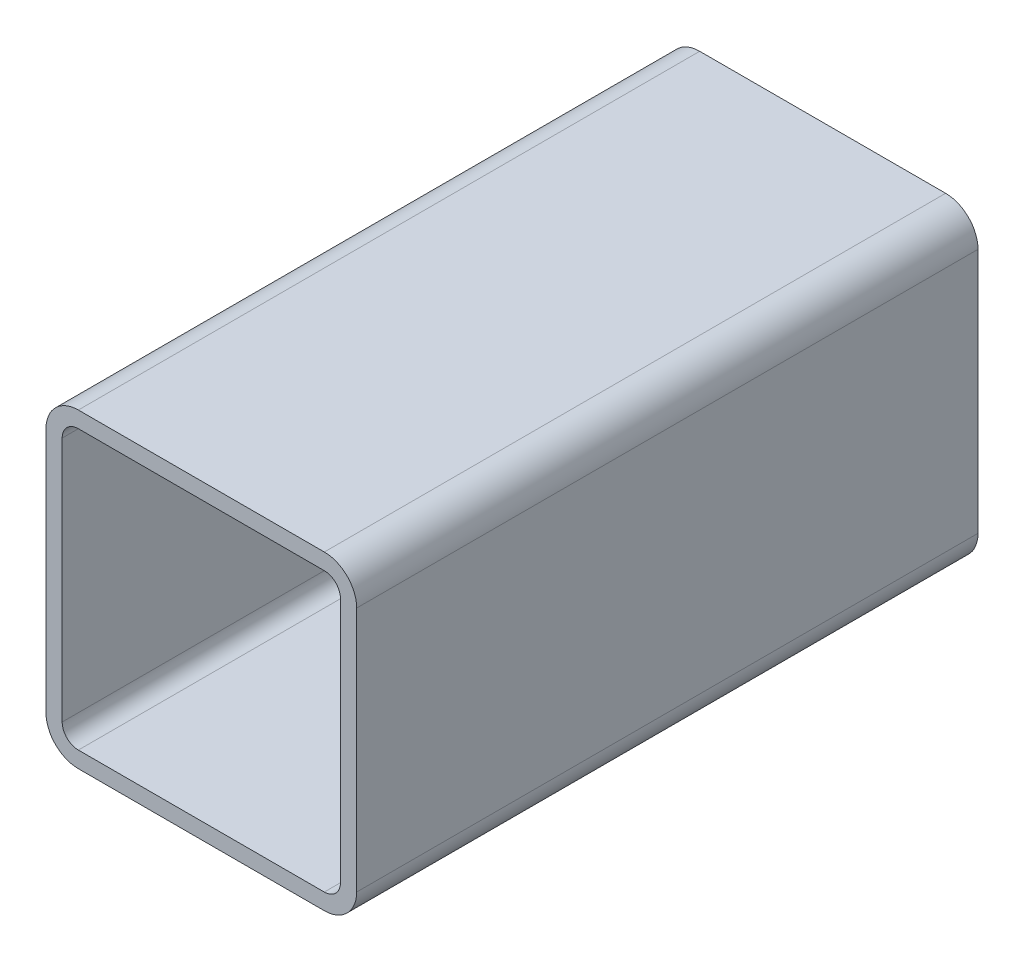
ISO-10303-21;
HEADER;
FILE_DESCRIPTION(('STEP AP214'),'2;1');
FILE_NAME('part.step','',(''),(''),'','','');
FILE_SCHEMA(('AUTOMOTIVE_DESIGN { 1 0 10303 214 1 1 1 1 }'));
ENDSEC;
DATA;
#1=APPLICATION_CONTEXT('core data for automotive mechanical design processes');
#2=APPLICATION_PROTOCOL_DEFINITION('international standard','automotive_design',2000,#1);
#3=PRODUCT_CONTEXT('',#1,'mechanical');
#4=PRODUCT('Part','Part','',(#3));
#5=PRODUCT_RELATED_PRODUCT_CATEGORY('part','',(#4));
#6=PRODUCT_DEFINITION_FORMATION('','',#4);
#7=PRODUCT_DEFINITION_CONTEXT('part definition',#1,'design');
#8=PRODUCT_DEFINITION('design','',#6,#7);
#9=PRODUCT_DEFINITION_SHAPE('','',#8);
#10=(LENGTH_UNIT() NAMED_UNIT(*) SI_UNIT(.MILLI.,.METRE.));
#11=(NAMED_UNIT(*) PLANE_ANGLE_UNIT() SI_UNIT($,.RADIAN.));
#12=(NAMED_UNIT(*) SI_UNIT($,.STERADIAN.) SOLID_ANGLE_UNIT());
#13=UNCERTAINTY_MEASURE_WITH_UNIT(LENGTH_MEASURE(1.E-05),#10,'distance_accuracy_value','');
#14=(GEOMETRIC_REPRESENTATION_CONTEXT(3) GLOBAL_UNCERTAINTY_ASSIGNED_CONTEXT((#13)) GLOBAL_UNIT_ASSIGNED_CONTEXT((#10,
#11,#12)) REPRESENTATION_CONTEXT('',''));
#15=CARTESIAN_POINT('',(0.,0.,0.));
#16=DIRECTION('',(0.,0.,1.));
#17=DIRECTION('',(1.,0.,0.));
#18=AXIS2_PLACEMENT_3D('',#15,#16,#17);
#19=CARTESIAN_POINT('',(15.9223013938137,138.536948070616,304.8));
#20=DIRECTION('',(0.,0.,1.));
#21=DIRECTION('',(1.,0.,0.));
#22=AXIS2_PLACEMENT_3D('',#19,#20,#21);
#23=PLANE('',#22);
#24=CARTESIAN_POINT('',(15.9223013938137,138.536948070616,304.8));
#25=DIRECTION('',(0.,0.,1.));
#26=DIRECTION('',(1.,0.,0.));
#27=AXIS2_PLACEMENT_3D('',#24,#25,#26);
#28=CIRCLE('',#27,15.875);
#29=CARTESIAN_POINT('',(15.9223013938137,154.411948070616,304.8));
#30=VERTEX_POINT('',#29);
#31=CARTESIAN_POINT('',(0.0473013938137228,138.536948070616,304.8));
#32=VERTEX_POINT('',#31);
#33=EDGE_CURVE('E211',#30,#32,#28,.T.);
#34=ORIENTED_EDGE('',*,*,#33,.T.);
#35=DIRECTION('',(0.,-1.,0.));
#36=VECTOR('',#35,1.);
#37=CARTESIAN_POINT('',(0.0473013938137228,17.8869480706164,304.8));
#38=LINE('',#37,#36);
#39=CARTESIAN_POINT('',(0.0473013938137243,17.8869480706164,304.8));
#40=VERTEX_POINT('',#39);
#41=EDGE_CURVE('E214',#32,#40,#38,.T.);
#42=ORIENTED_EDGE('',*,*,#41,.T.);
#43=CARTESIAN_POINT('',(15.9223013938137,17.8869480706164,304.8));
#44=DIRECTION('',(0.,0.,1.));
#45=DIRECTION('',(1.,0.,0.));
#46=AXIS2_PLACEMENT_3D('',#43,#44,#45);
#47=CIRCLE('',#46,15.875);
#48=CARTESIAN_POINT('',(15.9223013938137,2.01194807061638,304.8));
#49=VERTEX_POINT('',#48);
#50=EDGE_CURVE('E217',#40,#49,#47,.T.);
#51=ORIENTED_EDGE('',*,*,#50,.T.);
#52=DIRECTION('',(1.,0.,0.));
#53=VECTOR('',#52,1.);
#54=CARTESIAN_POINT('',(136.572301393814,2.01194807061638,304.8));
#55=LINE('',#54,#53);
#56=CARTESIAN_POINT('',(136.572301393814,2.01194807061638,304.8));
#57=VERTEX_POINT('',#56);
#58=EDGE_CURVE('E219',#49,#57,#55,.T.);
#59=ORIENTED_EDGE('',*,*,#58,.T.);
#60=CARTESIAN_POINT('',(136.572301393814,17.8869480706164,304.8));
#61=DIRECTION('',(0.,0.,1.));
#62=DIRECTION('',(1.,0.,0.));
#63=AXIS2_PLACEMENT_3D('',#60,#61,#62);
#64=CIRCLE('',#63,15.875);
#65=CARTESIAN_POINT('',(152.447301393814,17.8869480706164,304.8));
#66=VERTEX_POINT('',#65);
#67=EDGE_CURVE('E221',#57,#66,#64,.T.);
#68=ORIENTED_EDGE('',*,*,#67,.T.);
#69=DIRECTION('',(0.,1.,0.));
#70=VECTOR('',#69,1.);
#71=CARTESIAN_POINT('',(152.447301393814,138.536948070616,304.8));
#72=LINE('',#71,#70);
#73=CARTESIAN_POINT('',(152.447301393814,138.536948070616,304.8));
#74=VERTEX_POINT('',#73);
#75=EDGE_CURVE('E223',#66,#74,#72,.T.);
#76=ORIENTED_EDGE('',*,*,#75,.T.);
#77=CARTESIAN_POINT('',(136.572301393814,138.536948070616,304.8));
#78=DIRECTION('',(0.,0.,1.));
#79=DIRECTION('',(1.,0.,0.));
#80=AXIS2_PLACEMENT_3D('',#77,#78,#79);
#81=CIRCLE('',#80,15.875);
#82=CARTESIAN_POINT('',(136.572301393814,154.411948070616,304.8));
#83=VERTEX_POINT('',#82);
#84=EDGE_CURVE('E225',#74,#83,#81,.T.);
#85=ORIENTED_EDGE('',*,*,#84,.T.);
#86=DIRECTION('',(-1.,0.,0.));
#87=VECTOR('',#86,1.);
#88=CARTESIAN_POINT('',(15.9223013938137,154.411948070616,304.8));
#89=LINE('',#88,#87);
#90=EDGE_CURVE('E227',#83,#30,#89,.T.);
#91=ORIENTED_EDGE('',*,*,#90,.T.);
#92=EDGE_LOOP('',(#34,#42,#51,#59,#68,#76,#85,#91));
#93=FACE_BOUND('',#92,.T.);
#94=DIRECTION('',(0.,-1.,0.));
#95=VECTOR('',#94,1.);
#96=CARTESIAN_POINT('',(7.98480139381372,17.8869480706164,304.8));
#97=LINE('',#96,#95);
#98=CARTESIAN_POINT('',(7.98480139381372,138.536948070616,304.8));
#99=VERTEX_POINT('',#98);
#100=CARTESIAN_POINT('',(7.98480139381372,17.8869480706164,304.8));
#101=VERTEX_POINT('',#100);
#102=EDGE_CURVE('E154',#99,#101,#97,.T.);
#103=ORIENTED_EDGE('',*,*,#102,.F.);
#104=CARTESIAN_POINT('',(15.9223013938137,138.536948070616,304.8));
#105=DIRECTION('',(0.,0.,1.));
#106=DIRECTION('',(1.,0.,0.));
#107=AXIS2_PLACEMENT_3D('',#104,#105,#106);
#108=CIRCLE('',#107,7.93750000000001);
#109=CARTESIAN_POINT('',(15.9223013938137,146.474448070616,304.8));
#110=VERTEX_POINT('',#109);
#111=EDGE_CURVE('E146',#110,#99,#108,.T.);
#112=ORIENTED_EDGE('',*,*,#111,.F.);
#113=DIRECTION('',(-1.,0.,0.));
#114=VECTOR('',#113,1.);
#115=CARTESIAN_POINT('',(15.9223013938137,146.474448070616,304.8));
#116=LINE('',#115,#114);
#117=CARTESIAN_POINT('',(136.572301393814,146.474448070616,304.8));
#118=VERTEX_POINT('',#117);
#119=EDGE_CURVE('E179',#118,#110,#116,.T.);
#120=ORIENTED_EDGE('',*,*,#119,.F.);
#121=CARTESIAN_POINT('',(136.572301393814,138.536948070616,304.8));
#122=DIRECTION('',(0.,0.,1.));
#123=DIRECTION('',(1.,0.,0.));
#124=AXIS2_PLACEMENT_3D('',#121,#122,#123);
#125=CIRCLE('',#124,7.93750000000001);
#126=CARTESIAN_POINT('',(144.509801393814,138.536948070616,304.8));
#127=VERTEX_POINT('',#126);
#128=EDGE_CURVE('E177',#127,#118,#125,.T.);
#129=ORIENTED_EDGE('',*,*,#128,.F.);
#130=DIRECTION('',(0.,1.,0.));
#131=VECTOR('',#130,1.);
#132=CARTESIAN_POINT('',(144.509801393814,138.536948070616,304.8));
#133=LINE('',#132,#131);
#134=CARTESIAN_POINT('',(144.509801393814,17.8869480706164,304.8));
#135=VERTEX_POINT('',#134);
#136=EDGE_CURVE('E175',#135,#127,#133,.T.);
#137=ORIENTED_EDGE('',*,*,#136,.F.);
#138=CARTESIAN_POINT('',(136.572301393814,17.8869480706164,304.8));
#139=DIRECTION('',(0.,0.,1.));
#140=DIRECTION('',(1.,0.,0.));
#141=AXIS2_PLACEMENT_3D('',#138,#139,#140);
#142=CIRCLE('',#141,7.93750000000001);
#143=CARTESIAN_POINT('',(136.572301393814,9.94944807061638,304.8));
#144=VERTEX_POINT('',#143);
#145=EDGE_CURVE('E173',#144,#135,#142,.T.);
#146=ORIENTED_EDGE('',*,*,#145,.F.);
#147=DIRECTION('',(1.,0.,0.));
#148=VECTOR('',#147,1.);
#149=CARTESIAN_POINT('',(136.572301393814,9.94944807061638,304.8));
#150=LINE('',#149,#148);
#151=CARTESIAN_POINT('',(15.9223013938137,9.94944807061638,304.8));
#152=VERTEX_POINT('',#151);
#153=EDGE_CURVE('E169',#152,#144,#150,.T.);
#154=ORIENTED_EDGE('',*,*,#153,.F.);
#155=CARTESIAN_POINT('',(15.9223013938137,17.8869480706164,304.8));
#156=DIRECTION('',(0.,0.,1.));
#157=DIRECTION('',(1.,0.,0.));
#158=AXIS2_PLACEMENT_3D('',#155,#156,#157);
#159=CIRCLE('',#158,7.9375);
#160=EDGE_CURVE('E167',#101,#152,#159,.T.);
#161=ORIENTED_EDGE('',*,*,#160,.F.);
#162=EDGE_LOOP('',(#103,#112,#120,#129,#137,#146,#154,#161));
#163=FACE_BOUND('',#162,.T.);
#164=ADVANCED_FACE('F33',(#93,#163),#23,.T.);
#165=CARTESIAN_POINT('',(15.9223013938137,138.536948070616,0.));
#166=DIRECTION('',(0.,0.,1.));
#167=DIRECTION('',(1.,0.,0.));
#168=AXIS2_PLACEMENT_3D('',#165,#166,#167);
#169=PLANE('',#168);
#170=CARTESIAN_POINT('',(15.9223013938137,138.536948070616,0.));
#171=DIRECTION('',(0.,0.,1.));
#172=DIRECTION('',(1.,0.,0.));
#173=AXIS2_PLACEMENT_3D('',#170,#171,#172);
#174=CIRCLE('',#173,15.875);
#175=CARTESIAN_POINT('',(15.9223013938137,154.411948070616,0.));
#176=VERTEX_POINT('',#175);
#177=CARTESIAN_POINT('',(0.0473013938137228,138.536948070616,0.));
#178=VERTEX_POINT('',#177);
#179=EDGE_CURVE('E162',#176,#178,#174,.T.);
#180=ORIENTED_EDGE('',*,*,#179,.F.);
#181=DIRECTION('',(-1.,0.,0.));
#182=VECTOR('',#181,1.);
#183=CARTESIAN_POINT('',(15.9223013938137,154.411948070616,0.));
#184=LINE('',#183,#182);
#185=CARTESIAN_POINT('',(136.572301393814,154.411948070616,0.));
#186=VERTEX_POINT('',#185);
#187=EDGE_CURVE('E215',#186,#176,#184,.T.);
#188=ORIENTED_EDGE('',*,*,#187,.F.);
#189=CARTESIAN_POINT('',(136.572301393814,138.536948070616,0.));
#190=DIRECTION('',(0.,0.,1.));
#191=DIRECTION('',(1.,0.,0.));
#192=AXIS2_PLACEMENT_3D('',#189,#190,#191);
#193=CIRCLE('',#192,15.875);
#194=CARTESIAN_POINT('',(152.447301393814,138.536948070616,0.));
#195=VERTEX_POINT('',#194);
#196=EDGE_CURVE('E242',#195,#186,#193,.T.);
#197=ORIENTED_EDGE('',*,*,#196,.F.);
#198=DIRECTION('',(0.,1.,0.));
#199=VECTOR('',#198,1.);
#200=CARTESIAN_POINT('',(152.447301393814,138.536948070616,0.));
#201=LINE('',#200,#199);
#202=CARTESIAN_POINT('',(152.447301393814,17.8869480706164,0.));
#203=VERTEX_POINT('',#202);
#204=EDGE_CURVE('E240',#203,#195,#201,.T.);
#205=ORIENTED_EDGE('',*,*,#204,.F.);
#206=CARTESIAN_POINT('',(136.572301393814,17.8869480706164,0.));
#207=DIRECTION('',(0.,0.,1.));
#208=DIRECTION('',(1.,0.,0.));
#209=AXIS2_PLACEMENT_3D('',#206,#207,#208);
#210=CIRCLE('',#209,15.875);
#211=CARTESIAN_POINT('',(136.572301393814,2.01194807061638,0.));
#212=VERTEX_POINT('',#211);
#213=EDGE_CURVE('E238',#212,#203,#210,.T.);
#214=ORIENTED_EDGE('',*,*,#213,.F.);
#215=DIRECTION('',(1.,0.,0.));
#216=VECTOR('',#215,1.);
#217=CARTESIAN_POINT('',(136.572301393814,2.01194807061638,0.));
#218=LINE('',#217,#216);
#219=CARTESIAN_POINT('',(15.9223013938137,2.01194807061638,0.));
#220=VERTEX_POINT('',#219);
#221=EDGE_CURVE('E236',#220,#212,#218,.T.);
#222=ORIENTED_EDGE('',*,*,#221,.F.);
#223=CARTESIAN_POINT('',(15.9223013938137,17.8869480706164,0.));
#224=DIRECTION('',(0.,0.,1.));
#225=DIRECTION('',(1.,0.,0.));
#226=AXIS2_PLACEMENT_3D('',#223,#224,#225);
#227=CIRCLE('',#226,15.875);
#228=CARTESIAN_POINT('',(0.0473013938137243,17.8869480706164,0.));
#229=VERTEX_POINT('',#228);
#230=EDGE_CURVE('E234',#229,#220,#227,.T.);
#231=ORIENTED_EDGE('',*,*,#230,.F.);
#232=DIRECTION('',(0.,-1.,0.));
#233=VECTOR('',#232,1.);
#234=CARTESIAN_POINT('',(0.0473013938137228,17.8869480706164,0.));
#235=LINE('',#234,#233);
#236=EDGE_CURVE('E232',#178,#229,#235,.T.);
#237=ORIENTED_EDGE('',*,*,#236,.F.);
#238=EDGE_LOOP('',(#180,#188,#197,#205,#214,#222,#231,#237));
#239=FACE_BOUND('',#238,.T.);
#240=CARTESIAN_POINT('',(15.9223013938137,138.536948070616,0.));
#241=DIRECTION('',(0.,0.,1.));
#242=DIRECTION('',(1.,0.,0.));
#243=AXIS2_PLACEMENT_3D('',#240,#241,#242);
#244=CIRCLE('',#243,7.93750000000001);
#245=CARTESIAN_POINT('',(15.9223013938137,146.474448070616,0.));
#246=VERTEX_POINT('',#245);
#247=CARTESIAN_POINT('',(7.98480139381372,138.536948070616,0.));
#248=VERTEX_POINT('',#247);
#249=EDGE_CURVE('E56',#246,#248,#244,.T.);
#250=ORIENTED_EDGE('',*,*,#249,.T.);
#251=DIRECTION('',(0.,-1.,0.));
#252=VECTOR('',#251,1.);
#253=CARTESIAN_POINT('',(7.98480139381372,17.8869480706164,0.));
#254=LINE('',#253,#252);
#255=CARTESIAN_POINT('',(7.98480139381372,17.8869480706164,0.));
#256=VERTEX_POINT('',#255);
#257=EDGE_CURVE('E161',#248,#256,#254,.T.);
#258=ORIENTED_EDGE('',*,*,#257,.T.);
#259=CARTESIAN_POINT('',(15.9223013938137,17.8869480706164,0.));
#260=DIRECTION('',(0.,0.,1.));
#261=DIRECTION('',(1.,0.,0.));
#262=AXIS2_PLACEMENT_3D('',#259,#260,#261);
#263=CIRCLE('',#262,7.9375);
#264=CARTESIAN_POINT('',(15.9223013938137,9.94944807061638,0.));
#265=VERTEX_POINT('',#264);
#266=EDGE_CURVE('E183',#256,#265,#263,.T.);
#267=ORIENTED_EDGE('',*,*,#266,.T.);
#268=DIRECTION('',(1.,0.,0.));
#269=VECTOR('',#268,1.);
#270=CARTESIAN_POINT('',(136.572301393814,9.94944807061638,0.));
#271=LINE('',#270,#269);
#272=CARTESIAN_POINT('',(136.572301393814,9.94944807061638,0.));
#273=VERTEX_POINT('',#272);
#274=EDGE_CURVE('E186',#265,#273,#271,.T.);
#275=ORIENTED_EDGE('',*,*,#274,.T.);
#276=CARTESIAN_POINT('',(136.572301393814,17.8869480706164,0.));
#277=DIRECTION('',(0.,0.,1.));
#278=DIRECTION('',(1.,0.,0.));
#279=AXIS2_PLACEMENT_3D('',#276,#277,#278);
#280=CIRCLE('',#279,7.93750000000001);
#281=CARTESIAN_POINT('',(144.509801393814,17.8869480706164,0.));
#282=VERTEX_POINT('',#281);
#283=EDGE_CURVE('E189',#273,#282,#280,.T.);
#284=ORIENTED_EDGE('',*,*,#283,.T.);
#285=DIRECTION('',(0.,1.,0.));
#286=VECTOR('',#285,1.);
#287=CARTESIAN_POINT('',(144.509801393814,138.536948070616,0.));
#288=LINE('',#287,#286);
#289=CARTESIAN_POINT('',(144.509801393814,138.536948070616,0.));
#290=VERTEX_POINT('',#289);
#291=EDGE_CURVE('E192',#282,#290,#288,.T.);
#292=ORIENTED_EDGE('',*,*,#291,.T.);
#293=CARTESIAN_POINT('',(136.572301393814,138.536948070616,0.));
#294=DIRECTION('',(0.,0.,1.));
#295=DIRECTION('',(1.,0.,0.));
#296=AXIS2_PLACEMENT_3D('',#293,#294,#295);
#297=CIRCLE('',#296,7.93750000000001);
#298=CARTESIAN_POINT('',(136.572301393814,146.474448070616,0.));
#299=VERTEX_POINT('',#298);
#300=EDGE_CURVE('E195',#290,#299,#297,.T.);
#301=ORIENTED_EDGE('',*,*,#300,.T.);
#302=DIRECTION('',(-1.,0.,0.));
#303=VECTOR('',#302,1.);
#304=CARTESIAN_POINT('',(15.9223013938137,146.474448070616,0.));
#305=LINE('',#304,#303);
#306=EDGE_CURVE('E155',#299,#246,#305,.T.);
#307=ORIENTED_EDGE('',*,*,#306,.T.);
#308=EDGE_LOOP('',(#250,#258,#267,#275,#284,#292,#301,#307));
#309=FACE_BOUND('',#308,.T.);
#310=ADVANCED_FACE('F272',(#239,#309),#169,.F.);
#311=CARTESIAN_POINT('',(15.9223013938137,138.536948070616,304.8));
#312=DIRECTION('',(0.,0.,-1.));
#313=DIRECTION('',(-1.,0.,0.));
#314=AXIS2_PLACEMENT_3D('',#311,#312,#313);
#315=CYLINDRICAL_SURFACE('',#314,15.875);
#316=ORIENTED_EDGE('',*,*,#179,.T.);
#317=DIRECTION('',(0.,0.,-1.));
#318=VECTOR('',#317,1.);
#319=CARTESIAN_POINT('',(0.0473013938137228,138.536948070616,304.8));
#320=LINE('',#319,#318);
#321=EDGE_CURVE('E11',#32,#178,#320,.T.);
#322=ORIENTED_EDGE('',*,*,#321,.F.);
#323=ORIENTED_EDGE('',*,*,#33,.F.);
#324=DIRECTION('',(0.,0.,-1.));
#325=VECTOR('',#324,1.);
#326=CARTESIAN_POINT('',(15.9223013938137,154.411948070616,304.8));
#327=LINE('',#326,#325);
#328=EDGE_CURVE('E229',#30,#176,#327,.T.);
#329=ORIENTED_EDGE('',*,*,#328,.T.);
#330=EDGE_LOOP('',(#316,#322,#323,#329));
#331=FACE_BOUND('',#330,.T.);
#332=ADVANCED_FACE('F35',(#331),#315,.T.);
#333=CARTESIAN_POINT('',(0.0473013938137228,17.8869480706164,304.8));
#334=DIRECTION('',(1.,0.,0.));
#335=DIRECTION('',(0.,0.,-1.));
#336=AXIS2_PLACEMENT_3D('',#333,#334,#335);
#337=PLANE('',#336);
#338=ORIENTED_EDGE('',*,*,#236,.T.);
#339=DIRECTION('',(0.,0.,-1.));
#340=VECTOR('',#339,1.);
#341=CARTESIAN_POINT('',(0.0473013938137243,17.8869480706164,304.8));
#342=LINE('',#341,#340);
#343=EDGE_CURVE('E41',#40,#229,#342,.T.);
#344=ORIENTED_EDGE('',*,*,#343,.F.);
#345=ORIENTED_EDGE('',*,*,#41,.F.);
#346=ORIENTED_EDGE('',*,*,#321,.T.);
#347=EDGE_LOOP('',(#338,#344,#345,#346));
#348=FACE_BOUND('',#347,.T.);
#349=ADVANCED_FACE('F289',(#348),#337,.F.);
#350=CARTESIAN_POINT('',(15.9223013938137,17.8869480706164,304.8));
#351=DIRECTION('',(0.,0.,-1.));
#352=DIRECTION('',(-1.,0.,0.));
#353=AXIS2_PLACEMENT_3D('',#350,#351,#352);
#354=CYLINDRICAL_SURFACE('',#353,15.875);
#355=ORIENTED_EDGE('',*,*,#230,.T.);
#356=DIRECTION('',(0.,0.,-1.));
#357=VECTOR('',#356,1.);
#358=CARTESIAN_POINT('',(15.9223013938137,2.01194807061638,304.8));
#359=LINE('',#358,#357);
#360=EDGE_CURVE('E259',#49,#220,#359,.T.);
#361=ORIENTED_EDGE('',*,*,#360,.F.);
#362=ORIENTED_EDGE('',*,*,#50,.F.);
#363=ORIENTED_EDGE('',*,*,#343,.T.);
#364=EDGE_LOOP('',(#355,#361,#362,#363));
#365=FACE_BOUND('',#364,.T.);
#366=ADVANCED_FACE('F266',(#365),#354,.T.);
#367=CARTESIAN_POINT('',(136.572301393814,2.01194807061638,304.8));
#368=DIRECTION('',(0.,1.,0.));
#369=DIRECTION('',(0.,0.,1.));
#370=AXIS2_PLACEMENT_3D('',#367,#368,#369);
#371=PLANE('',#370);
#372=ORIENTED_EDGE('',*,*,#221,.T.);
#373=DIRECTION('',(0.,0.,-1.));
#374=VECTOR('',#373,1.);
#375=CARTESIAN_POINT('',(136.572301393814,2.01194807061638,304.8));
#376=LINE('',#375,#374);
#377=EDGE_CURVE('E256',#57,#212,#376,.T.);
#378=ORIENTED_EDGE('',*,*,#377,.F.);
#379=ORIENTED_EDGE('',*,*,#58,.F.);
#380=ORIENTED_EDGE('',*,*,#360,.T.);
#381=EDGE_LOOP('',(#372,#378,#379,#380));
#382=FACE_BOUND('',#381,.T.);
#383=ADVANCED_FACE('F278',(#382),#371,.F.);
#384=CARTESIAN_POINT('',(136.572301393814,17.8869480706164,304.8));
#385=DIRECTION('',(0.,0.,-1.));
#386=DIRECTION('',(-1.,0.,0.));
#387=AXIS2_PLACEMENT_3D('',#384,#385,#386);
#388=CYLINDRICAL_SURFACE('',#387,15.875);
#389=ORIENTED_EDGE('',*,*,#213,.T.);
#390=DIRECTION('',(0.,0.,-1.));
#391=VECTOR('',#390,1.);
#392=CARTESIAN_POINT('',(152.447301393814,17.8869480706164,304.8));
#393=LINE('',#392,#391);
#394=EDGE_CURVE('E253',#66,#203,#393,.T.);
#395=ORIENTED_EDGE('',*,*,#394,.F.);
#396=ORIENTED_EDGE('',*,*,#67,.F.);
#397=ORIENTED_EDGE('',*,*,#377,.T.);
#398=EDGE_LOOP('',(#389,#395,#396,#397));
#399=FACE_BOUND('',#398,.T.);
#400=ADVANCED_FACE('F282',(#399),#388,.T.);
#401=CARTESIAN_POINT('',(152.447301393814,138.536948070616,304.8));
#402=DIRECTION('',(-1.,0.,0.));
#403=DIRECTION('',(0.,0.,1.));
#404=AXIS2_PLACEMENT_3D('',#401,#402,#403);
#405=PLANE('',#404);
#406=ORIENTED_EDGE('',*,*,#204,.T.);
#407=DIRECTION('',(0.,0.,-1.));
#408=VECTOR('',#407,1.);
#409=CARTESIAN_POINT('',(152.447301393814,138.536948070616,304.8));
#410=LINE('',#409,#408);
#411=EDGE_CURVE('E250',#74,#195,#410,.T.);
#412=ORIENTED_EDGE('',*,*,#411,.F.);
#413=ORIENTED_EDGE('',*,*,#75,.F.);
#414=ORIENTED_EDGE('',*,*,#394,.T.);
#415=EDGE_LOOP('',(#406,#412,#413,#414));
#416=FACE_BOUND('',#415,.T.);
#417=ADVANCED_FACE('F302',(#416),#405,.F.);
#418=CARTESIAN_POINT('',(136.572301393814,138.536948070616,304.8));
#419=DIRECTION('',(0.,0.,-1.));
#420=DIRECTION('',(-1.,0.,0.));
#421=AXIS2_PLACEMENT_3D('',#418,#419,#420);
#422=CYLINDRICAL_SURFACE('',#421,15.875);
#423=ORIENTED_EDGE('',*,*,#196,.T.);
#424=DIRECTION('',(0.,0.,-1.));
#425=VECTOR('',#424,1.);
#426=CARTESIAN_POINT('',(136.572301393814,154.411948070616,304.8));
#427=LINE('',#426,#425);
#428=EDGE_CURVE('E247',#83,#186,#427,.T.);
#429=ORIENTED_EDGE('',*,*,#428,.F.);
#430=ORIENTED_EDGE('',*,*,#84,.F.);
#431=ORIENTED_EDGE('',*,*,#411,.T.);
#432=EDGE_LOOP('',(#423,#429,#430,#431));
#433=FACE_BOUND('',#432,.T.);
#434=ADVANCED_FACE('F300',(#433),#422,.T.);
#435=CARTESIAN_POINT('',(15.9223013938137,154.411948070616,304.8));
#436=DIRECTION('',(0.,-1.,0.));
#437=DIRECTION('',(0.,0.,-1.));
#438=AXIS2_PLACEMENT_3D('',#435,#436,#437);
#439=PLANE('',#438);
#440=ORIENTED_EDGE('',*,*,#187,.T.);
#441=ORIENTED_EDGE('',*,*,#328,.F.);
#442=ORIENTED_EDGE('',*,*,#90,.F.);
#443=ORIENTED_EDGE('',*,*,#428,.T.);
#444=EDGE_LOOP('',(#440,#441,#442,#443));
#445=FACE_BOUND('',#444,.T.);
#446=ADVANCED_FACE('F295',(#445),#439,.F.);
#447=CARTESIAN_POINT('',(15.9223013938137,138.536948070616,304.8));
#448=DIRECTION('',(0.,0.,-1.));
#449=DIRECTION('',(-1.,0.,0.));
#450=AXIS2_PLACEMENT_3D('',#447,#448,#449);
#451=CYLINDRICAL_SURFACE('',#450,7.93750000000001);
#452=ORIENTED_EDGE('',*,*,#249,.F.);
#453=DIRECTION('',(0.,0.,-1.));
#454=VECTOR('',#453,1.);
#455=CARTESIAN_POINT('',(15.9223013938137,146.474448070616,304.8));
#456=LINE('',#455,#454);
#457=EDGE_CURVE('E150',#110,#246,#456,.T.);
#458=ORIENTED_EDGE('',*,*,#457,.F.);
#459=ORIENTED_EDGE('',*,*,#111,.T.);
#460=DIRECTION('',(0.,0.,-1.));
#461=VECTOR('',#460,1.);
#462=CARTESIAN_POINT('',(7.98480139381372,138.536948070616,304.8));
#463=LINE('',#462,#461);
#464=EDGE_CURVE('E149',#99,#248,#463,.T.);
#465=ORIENTED_EDGE('',*,*,#464,.T.);
#466=EDGE_LOOP('',(#452,#458,#459,#465));
#467=FACE_BOUND('',#466,.T.);
#468=ADVANCED_FACE('F148',(#467),#451,.F.);
#469=CARTESIAN_POINT('',(7.98480139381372,17.8869480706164,304.8));
#470=DIRECTION('',(1.,0.,0.));
#471=DIRECTION('',(0.,0.,-1.));
#472=AXIS2_PLACEMENT_3D('',#469,#470,#471);
#473=PLANE('',#472);
#474=ORIENTED_EDGE('',*,*,#257,.F.);
#475=ORIENTED_EDGE('',*,*,#464,.F.);
#476=ORIENTED_EDGE('',*,*,#102,.T.);
#477=DIRECTION('',(0.,0.,-1.));
#478=VECTOR('',#477,1.);
#479=CARTESIAN_POINT('',(7.98480139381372,17.8869480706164,304.8));
#480=LINE('',#479,#478);
#481=EDGE_CURVE('E163',#101,#256,#480,.T.);
#482=ORIENTED_EDGE('',*,*,#481,.T.);
#483=EDGE_LOOP('',(#474,#475,#476,#482));
#484=FACE_BOUND('',#483,.T.);
#485=ADVANCED_FACE('F158',(#484),#473,.T.);
#486=CARTESIAN_POINT('',(15.9223013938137,17.8869480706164,304.8));
#487=DIRECTION('',(0.,0.,-1.));
#488=DIRECTION('',(-1.,0.,0.));
#489=AXIS2_PLACEMENT_3D('',#486,#487,#488);
#490=CYLINDRICAL_SURFACE('',#489,7.9375);
#491=ORIENTED_EDGE('',*,*,#266,.F.);
#492=ORIENTED_EDGE('',*,*,#481,.F.);
#493=ORIENTED_EDGE('',*,*,#160,.T.);
#494=DIRECTION('',(0.,0.,-1.));
#495=VECTOR('',#494,1.);
#496=CARTESIAN_POINT('',(15.9223013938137,9.94944807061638,304.8));
#497=LINE('',#496,#495);
#498=EDGE_CURVE('E208',#152,#265,#497,.T.);
#499=ORIENTED_EDGE('',*,*,#498,.T.);
#500=EDGE_LOOP('',(#491,#492,#493,#499));
#501=FACE_BOUND('',#500,.T.);
#502=ADVANCED_FACE('F327',(#501),#490,.F.);
#503=CARTESIAN_POINT('',(136.572301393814,9.94944807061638,304.8));
#504=DIRECTION('',(0.,1.,0.));
#505=DIRECTION('',(0.,0.,1.));
#506=AXIS2_PLACEMENT_3D('',#503,#504,#505);
#507=PLANE('',#506);
#508=ORIENTED_EDGE('',*,*,#274,.F.);
#509=ORIENTED_EDGE('',*,*,#498,.F.);
#510=ORIENTED_EDGE('',*,*,#153,.T.);
#511=DIRECTION('',(0.,0.,-1.));
#512=VECTOR('',#511,1.);
#513=CARTESIAN_POINT('',(136.572301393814,9.94944807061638,304.8));
#514=LINE('',#513,#512);
#515=EDGE_CURVE('E206',#144,#273,#514,.T.);
#516=ORIENTED_EDGE('',*,*,#515,.T.);
#517=EDGE_LOOP('',(#508,#509,#510,#516));
#518=FACE_BOUND('',#517,.T.);
#519=ADVANCED_FACE('F331',(#518),#507,.T.);
#520=CARTESIAN_POINT('',(136.572301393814,17.8869480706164,304.8));
#521=DIRECTION('',(0.,0.,-1.));
#522=DIRECTION('',(-1.,0.,0.));
#523=AXIS2_PLACEMENT_3D('',#520,#521,#522);
#524=CYLINDRICAL_SURFACE('',#523,7.93750000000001);
#525=ORIENTED_EDGE('',*,*,#283,.F.);
#526=ORIENTED_EDGE('',*,*,#515,.F.);
#527=ORIENTED_EDGE('',*,*,#145,.T.);
#528=DIRECTION('',(0.,0.,-1.));
#529=VECTOR('',#528,1.);
#530=CARTESIAN_POINT('',(144.509801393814,17.8869480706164,304.8));
#531=LINE('',#530,#529);
#532=EDGE_CURVE('E204',#135,#282,#531,.T.);
#533=ORIENTED_EDGE('',*,*,#532,.T.);
#534=EDGE_LOOP('',(#525,#526,#527,#533));
#535=FACE_BOUND('',#534,.T.);
#536=ADVANCED_FACE('F337',(#535),#524,.F.);
#537=CARTESIAN_POINT('',(144.509801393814,138.536948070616,304.8));
#538=DIRECTION('',(-1.,0.,0.));
#539=DIRECTION('',(0.,0.,1.));
#540=AXIS2_PLACEMENT_3D('',#537,#538,#539);
#541=PLANE('',#540);
#542=ORIENTED_EDGE('',*,*,#291,.F.);
#543=ORIENTED_EDGE('',*,*,#532,.F.);
#544=ORIENTED_EDGE('',*,*,#136,.T.);
#545=DIRECTION('',(0.,0.,-1.));
#546=VECTOR('',#545,1.);
#547=CARTESIAN_POINT('',(144.509801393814,138.536948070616,304.8));
#548=LINE('',#547,#546);
#549=EDGE_CURVE('E202',#127,#290,#548,.T.);
#550=ORIENTED_EDGE('',*,*,#549,.T.);
#551=EDGE_LOOP('',(#542,#543,#544,#550));
#552=FACE_BOUND('',#551,.T.);
#553=ADVANCED_FACE('F341',(#552),#541,.T.);
#554=CARTESIAN_POINT('',(136.572301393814,138.536948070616,304.8));
#555=DIRECTION('',(0.,0.,-1.));
#556=DIRECTION('',(-1.,0.,0.));
#557=AXIS2_PLACEMENT_3D('',#554,#555,#556);
#558=CYLINDRICAL_SURFACE('',#557,7.93750000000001);
#559=ORIENTED_EDGE('',*,*,#300,.F.);
#560=ORIENTED_EDGE('',*,*,#549,.F.);
#561=ORIENTED_EDGE('',*,*,#128,.T.);
#562=DIRECTION('',(0.,0.,-1.));
#563=VECTOR('',#562,1.);
#564=CARTESIAN_POINT('',(136.572301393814,146.474448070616,304.8));
#565=LINE('',#564,#563);
#566=EDGE_CURVE('E48',#118,#299,#565,.T.);
#567=ORIENTED_EDGE('',*,*,#566,.T.);
#568=EDGE_LOOP('',(#559,#560,#561,#567));
#569=FACE_BOUND('',#568,.T.);
#570=ADVANCED_FACE('F345',(#569),#558,.F.);
#571=CARTESIAN_POINT('',(15.9223013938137,146.474448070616,304.8));
#572=DIRECTION('',(0.,-1.,0.));
#573=DIRECTION('',(0.,0.,-1.));
#574=AXIS2_PLACEMENT_3D('',#571,#572,#573);
#575=PLANE('',#574);
#576=ORIENTED_EDGE('',*,*,#306,.F.);
#577=ORIENTED_EDGE('',*,*,#566,.F.);
#578=ORIENTED_EDGE('',*,*,#119,.T.);
#579=ORIENTED_EDGE('',*,*,#457,.T.);
#580=EDGE_LOOP('',(#576,#577,#578,#579));
#581=FACE_BOUND('',#580,.T.);
#582=ADVANCED_FACE('F349',(#581),#575,.T.);
#583=CLOSED_SHELL('',(#164,#310,#332,#349,#366,#383,#400,#417,#434,#446,#468,#485,#502,#519,
#536,#553,#570,#582));
#584=MANIFOLD_SOLID_BREP('B2',#583);
#585=ADVANCED_BREP_SHAPE_REPRESENTATION('',(#18,#584),#14);
#586=SHAPE_DEFINITION_REPRESENTATION(#9,#585);
ENDSEC;
END-ISO-10303-21;
